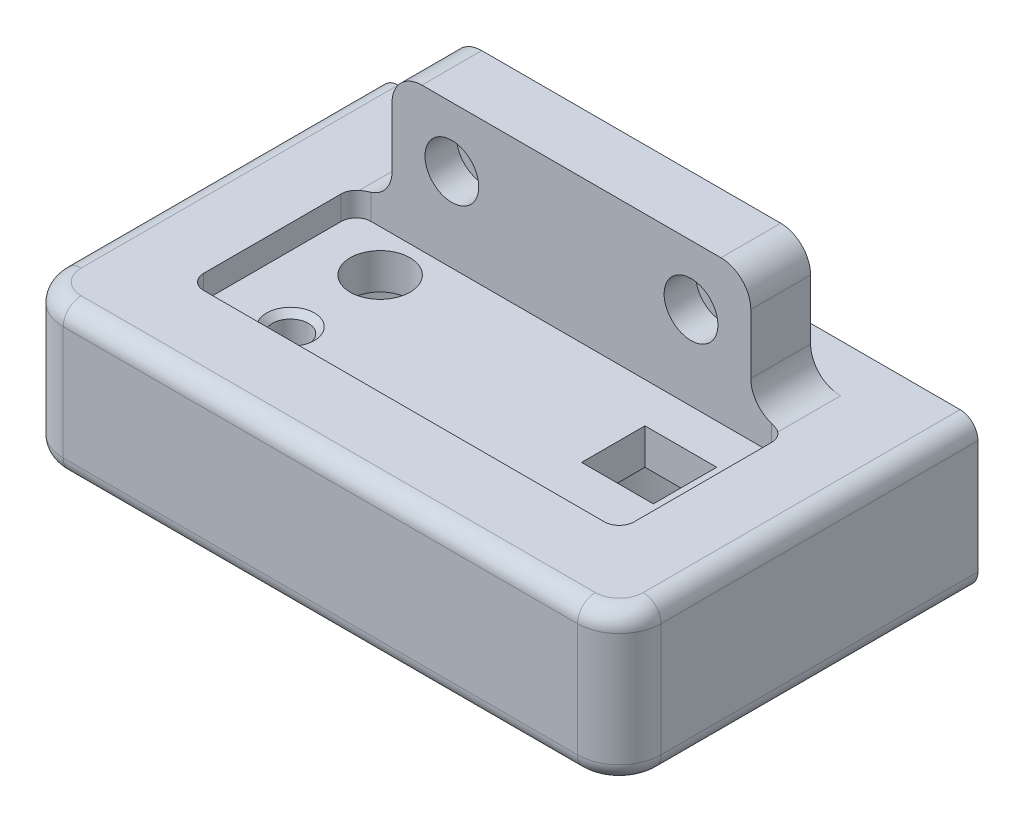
from build123d import *

# Parameters (mm, degrees)
SKETCH1_W           = 100
SKETCH1_H           = 25
BOSS_EXTRUDE1_DEPTH = 60
SKETCH5_W           = 60
SKETCH5_H           = 10
BOSS_EXTRUDE2_DEPTH = 20
SKETCH6_R           = 3
CUT_EXTRUDE2_DEPTH  = 10
CUT_EXTRUDE3_DEPTH  = 126
FILLET1_R           = 3
SKETCH8_R           = 20
CUT_EXTRUDE4_DEPTH  = 15
SKETCH9_R           = 4.5
CUT_EXTRUDE5_DEPTH  = 5.3
SKETCH10_R          = 5
SKETCH10_R_2        = 3
SKETCH10_W          = 12
SKETCH10_H          = 10.6
CUT_EXTRUDE6_DEPTH  = 10
CUT_EXTRUDE7_DEPTH  = 4
CHAMFER2_SIZE       = 1
REDONDEO1_R         = 5


with BuildPart() as part:
    # Sketch1 → Boss-Extrude1 (new body)
    with BuildSketch(Plane.XY):
        with Locations((50, 12.5)):
            Rectangle(SKETCH1_W, SKETCH1_H)
    extrude(amount=BOSS_EXTRUDE1_DEPTH)

    # Sketch5 → Boss-Extrude2 (add)
    with BuildSketch(Plane(origin=(0, 25, 0), x_dir=(1, 0, 0), z_dir=(0, 1, 0))):
        with Locations((50, -13)):
            Rectangle(SKETCH5_W, SKETCH5_H)
    extrude(amount=BOSS_EXTRUDE2_DEPTH)

    # Sketch6 → Cut-Extrude2 (cut)
    with BuildSketch(Plane(origin=(0, 0, 8), x_dir=(-1, 0, 0), z_dir=(0, 0, -1))):
        with Locations((-70, 35)):
            Circle(SKETCH6_R)
        with Locations((-30, 35)):
            Circle(SKETCH6_R)
    extrude(amount=-CUT_EXTRUDE2_DEPTH, mode=Mode.SUBTRACT)

    # Sketch7 → Cut-Extrude3 (cut, through all)
    with BuildSketch(Plane.XZ):
        with BuildLine():
            Line((0, 60), (0, 53))
            ThreePointArc((0, 53), (2.050252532, 57.949747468), (7, 60))
            Line((7, 60), (0, 60))
        make_face()
        with BuildLine():
            Line((100, 60), (93, 60))
            ThreePointArc((93, 60), (97.949747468, 57.949747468), (100, 53))
            Line((100, 53), (100, 60))
        make_face()
    extrude(amount=-CUT_EXTRUDE3_DEPTH, mode=Mode.SUBTRACT)

    # Fillet1
    fillet1_edges = [part.edges().sort_by_distance(p)[0] for p in [
        (50, 0, 60),
        (50, 25, 60),
        (100, 25, 26.5),
        (100, 0, 26.5),
        (0, 0, 26.5),
        (0, 25, 26.5),
        (2.050252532, 25, 57.949747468),
        (2.050252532, 0, 57.949747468),
        (97.949747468, 25, 57.949747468),
        (97.949747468, 0, 57.949747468),
    ]]
    fillet(fillet1_edges, radius=FILLET1_R)

    # Sketch8 → Cut-Extrude4 (cut)
    with BuildSketch(Plane.XZ):
        with Locations(Location((25, 30, 0), (0, 0, 270))):
            Circle(SKETCH8_R)
        with Locations(Location((75, 30, 0), (0, 0, 270))):
            Circle(SKETCH8_R)
    extrude(amount=-CUT_EXTRUDE4_DEPTH, mode=Mode.SUBTRACT)

    # Sketch9 → Cut-Extrude5 (cut)
    with BuildSketch(Plane.XY.offset(18)):
        with Locations((30, 35)):
            Circle(SKETCH9_R)
        with Locations((70, 35)):
            Circle(SKETCH9_R)
    extrude(amount=-CUT_EXTRUDE5_DEPTH, mode=Mode.SUBTRACT)

    # Sketch10 → Cut-Extrude6 (cut)
    with BuildSketch(Plane.XZ.offset(-15)):
        with Locations(Location((25, 25, 0), (0, 0, 90))):
            Circle(SKETCH10_R)
        with Locations(Location((25, 40, 0), (0, 0, 90))):
            Circle(SKETCH10_R_2)
        with Locations((75, 30)):
            Rectangle(SKETCH10_W, SKETCH10_H)
    extrude(amount=-CUT_EXTRUDE6_DEPTH, mode=Mode.SUBTRACT)

    # Sketch11 → Cut-Extrude7 (cut)
    with BuildSketch(Plane(origin=(0, 25, 0), x_dir=(1, 0, 0), z_dir=(0, 1, 0))):
        with BuildLine():
            Line((16.5, -46), (83.5, -46))
            ThreePointArc((83.5, -46), (85.267766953, -45.267766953), (86, -43.5))
            Line((86, -43.5), (86, -20.5))
            ThreePointArc((86, -20.5), (85.267766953, -18.732233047), (83.5, -18))
            Line((83.5, -18), (16.5, -18))
            ThreePointArc((16.5, -18), (14.732233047, -18.732233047), (14, -20.5))
            Line((14, -20.5), (14, -43.5))
            ThreePointArc((14, -43.5), (14.732233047, -45.267766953), (16.5, -46))
        make_face()
    extrude(amount=-CUT_EXTRUDE7_DEPTH, mode=Mode.SUBTRACT)

    # Chamfer2
    chamfer2_edges = [part.edges().sort_by_distance(p)[0] for p in [
        (25, 21, 37),
    ]]
    chamfer(chamfer2_edges, length=CHAMFER2_SIZE)

    # Redondeo1
    redondeo1_edges = [part.edges().sort_by_distance(p)[0] for p in [
        (20, 25, 13),
        (20, 45, 13),
        (80, 45, 13),
        (80, 25, 13),
    ]]
    fillet(redondeo1_edges, radius=REDONDEO1_R)


solid = part.part
